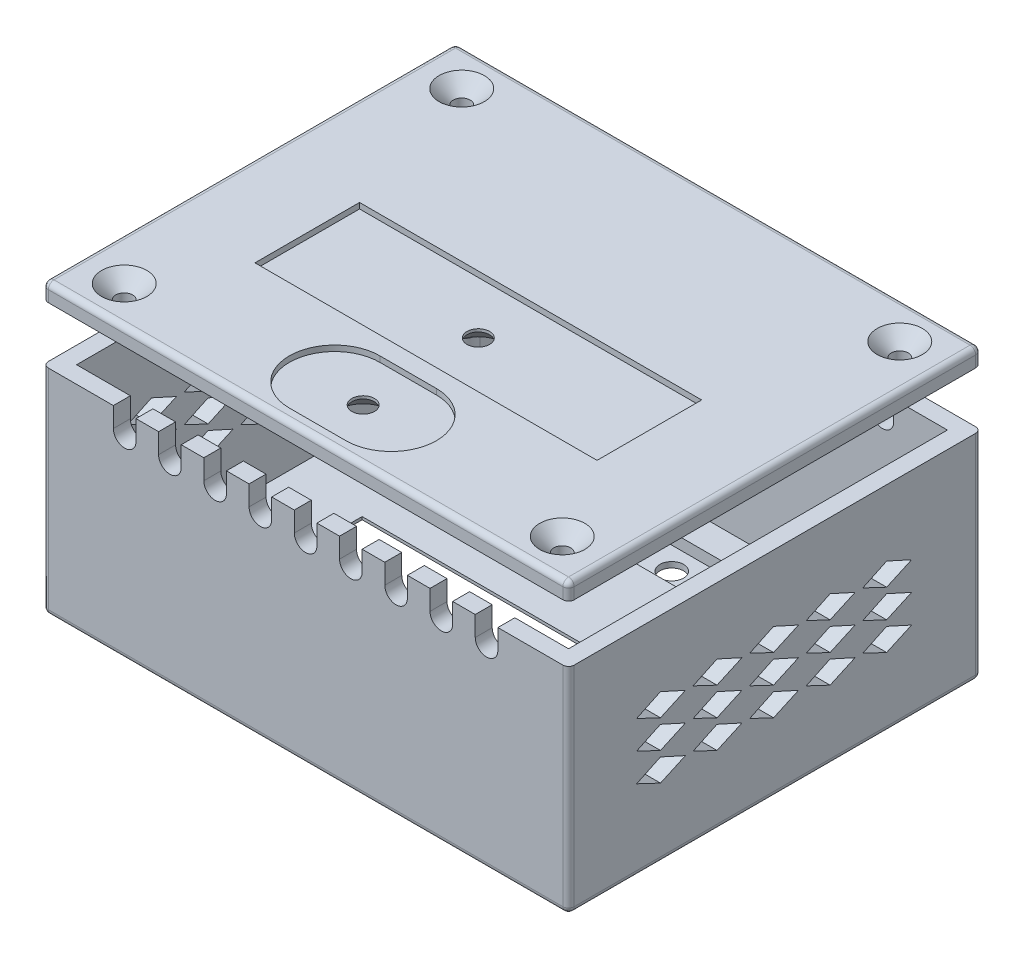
from build123d import *
from OCP.BRepFilletAPI import BRepFilletAPI_MakeChamfer

# Parameters (mm, degrees)
SKETCH_227_W            = 93
SKETCH_227_H            = 73
SKETCH_227_W_2          = 87
SKETCH_227_H_2          = 67
EXTRUDE_477_DEPTH       = 35
SKETCH_2_W              = 93
SKETCH_2_H              = 73
EXTRUDE_524_DEPTH       = 3
SKETCH_1_W              = 60
SKETCH_1_H              = 31
CUT_EXTRUDE_2861_DEPTH  = 3
EXTRUDE_3757_DEPTH      = 2
EXTRUDE_3757_DEPTH_BACK = 3
SKETCH_2_2_R            = 3
SKETCH_2_2_R_2          = 1.5
CHAMFER_3816_SIZE       = 2.5
CHAMFER_3816_SIZE2      = 3
SKETCH_1_3_W            = 28
SKETCH_1_3_H            = 8
CUT_EXTRUDE_1_DEPTH     = 2
SKETCH_1_4_R            = 2.1
CUT_EXTRUDE_2_DEPTH     = 69.698617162
SKETCH_1_5_R            = 1.25
EXTRUDE_3_DEPTH         = 5
FILLET_4_R              = 1
SKETCH_4282_R           = 1.5
EXTRUDE_5048_DEPTH      = 12
CUT_EXTRUDE_6380_DEPTH  = 129.932152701
CUT_EXTRUDE_7651_DEPTH  = 94.360859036
FILLET_2_R              = 1
SKETCH_7_W              = 93
SKETCH_7_H              = 73
SKETCH_7_R              = 1.5
EXTRUDE_8347_DEPTH      = 3
EXTRUDE_START           = -1
SKETCH_7_3_W            = 86
SKETCH_7_3_H            = 66
SKETCH_7_3_R            = 1.5
EXTRUDE_2_DEPTH         = 1
FILLET_3_R              = 1
CHAMFER_2_SIZE          = 2.5
SKETCH_4_W              = 60.5
SKETCH_4_H              = 18.5
CUT_EXTRUDE_1_2_DEPTH   = 1
SKETCH_4_3_R            = 2
CUT_EXTRUDE_2_2_DEPTH   = 5
CHAMFER_3_SIZE          = 2.5
SKETCH_8_W              = 2.198076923
SKETCH_8_H              = 1.058333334
CUT_EXTRUDE_10181_DEPTH = 1


with BuildPart() as part:
    # Sketch 227 → Extrude 477 (new body)
    with BuildSketch(Plane(origin=(0, 0, 0), x_dir=(1, 0, 0), z_dir=(0, 1, 0))):
        Rectangle(SKETCH_227_W, SKETCH_227_H)
        Rectangle(SKETCH_227_W_2, SKETCH_227_H_2, mode=Mode.SUBTRACT)
    extrude(amount=EXTRUDE_477_DEPTH)

    # Sketch 2 → Extrude 524 (add)
    with BuildSketch(Plane(origin=(0, 0, 0), x_dir=(1, 0, 0), z_dir=(0, 1, 0))):
        Rectangle(SKETCH_2_W, SKETCH_2_H)
    extrude(amount=-EXTRUDE_524_DEPTH)

    # Sketch 1 → Cut-Extrude 2861 (cut)
    with BuildSketch(Plane.XZ):
        with Locations((0, 12)):
            Rectangle(SKETCH_1_W, SKETCH_1_H)
    extrude(amount=CUT_EXTRUDE_2861_DEPTH, mode=Mode.SUBTRACT)

    # Sketch 2 2 → Extrude 3757 (add, two sides: drawn at the far end of the back side and taken through both)
    # profile 1 of 4: a face of its own
    with BuildSketch(Plane.XZ.offset(-EXTRUDE_3757_DEPTH_BACK)):
        with Locations(Location((-32.75, -12.5, 0), (0, 0, 270))):
            Circle(SKETCH_2_2_R)
        with Locations(Location((-32.75, -12.5, 0), (0, 0, 270))):
            Circle(SKETCH_2_2_R_2, mode=Mode.SUBTRACT)
    # profile 2 of 4: a face of its own
    with BuildSketch(Plane.XZ.offset(-EXTRUDE_3757_DEPTH_BACK)):
        with Locations(Location((32.75, -12.5, 0), (0, 0, 90))):
            Circle(SKETCH_2_2_R)
        with Locations(Location((32.75, -12.5, 0), (0, 0, 90))):
            Circle(SKETCH_2_2_R_2, mode=Mode.SUBTRACT)
    # profile 3 of 4: a face of its own
    with BuildSketch(Plane.XZ.offset(-EXTRUDE_3757_DEPTH_BACK)):
        with BuildLine():
            Line((29.75, 30.5), (29.75, 35.108230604))
            Line((29.75, 35.108230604), (35.75, 35.108230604))
            Line((35.75, 35.108230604), (35.75, 30.5))
            ThreePointArc((35.75, 30.5), (32.75, 27.5), (29.75, 30.5))
        make_face()
        with Locations(Location((32.75, 30.5, 0), (0, 0, 90))):
            Circle(SKETCH_2_2_R_2, mode=Mode.SUBTRACT)
    # profile 4 of 4: a face of its own
    with BuildSketch(Plane.XZ.offset(-EXTRUDE_3757_DEPTH_BACK)):
        with BuildLine():
            Line((-35.75, 30.5), (-35.75, 35.108230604))
            Line((-35.75, 35.108230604), (-29.75, 35.108230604))
            Line((-29.75, 35.108230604), (-29.75, 30.5))
            ThreePointArc((-29.75, 30.5), (-32.75, 27.5), (-35.75, 30.5))
        make_face()
        with Locations(Location((-32.75, 30.5, 0), (0, 0, 270))):
            Circle(SKETCH_2_2_R_2, mode=Mode.SUBTRACT)
    extrude(amount=EXTRUDE_3757_DEPTH + EXTRUDE_3757_DEPTH_BACK)

    # Chamfer 3816: one chamfer whose edges measure the first distance from different faces: ONE call of the kernel's chamfer builder (chamfer() names one face for all edges)
    chamfer_3816_edges_1 = [part.edges().sort_by_distance(p)[0] for p in [
        (30, -3, 12),
    ]]
    chamfer_3816_side_1 = [part.faces().sort_by_distance(p)[0] for p in [
        (30, -1.5, 12),
    ]]
    chamfer_3816_edges_2 = [part.edges().sort_by_distance(p)[0] for p in [
        (0, -3, 27.5),
    ]]
    chamfer_3816_side_2 = [part.faces().sort_by_distance(p)[0] for p in [
        (0, -1.5, 27.5),
    ]]
    chamfer_3816_edges_3 = [part.edges().sort_by_distance(p)[0] for p in [
        (-30, -3, 12),
    ]]
    chamfer_3816_side_3 = [part.faces().sort_by_distance(p)[0] for p in [
        (-30, -1.5, 12),
    ]]
    chamfer_3816_edges_4 = [part.edges().sort_by_distance(p)[0] for p in [
        (0, -3, -3.5),
    ]]
    chamfer_3816_side_4 = [part.faces().sort_by_distance(p)[0] for p in [
        (0, -1.5, -3.5),
    ]]
    chamfer_3816 = BRepFilletAPI_MakeChamfer(part.part.solid().wrapped)
    for e in chamfer_3816_edges_1:
        chamfer_3816.Add(CHAMFER_3816_SIZE, CHAMFER_3816_SIZE2, e.wrapped, chamfer_3816_side_1[0].wrapped)  # the first distance lies on this face
    for e in chamfer_3816_edges_2:
        chamfer_3816.Add(CHAMFER_3816_SIZE, CHAMFER_3816_SIZE2, e.wrapped, chamfer_3816_side_2[0].wrapped)  # the first distance lies on this face
    for e in chamfer_3816_edges_3:
        chamfer_3816.Add(CHAMFER_3816_SIZE, CHAMFER_3816_SIZE2, e.wrapped, chamfer_3816_side_3[0].wrapped)  # the first distance lies on this face
    for e in chamfer_3816_edges_4:
        chamfer_3816.Add(CHAMFER_3816_SIZE, CHAMFER_3816_SIZE2, e.wrapped, chamfer_3816_side_4[0].wrapped)  # the first distance lies on this face
    add(Compound.cast(chamfer_3816.Shape()), mode=Mode.REPLACE)

    # Sketch 1_3 → Cut-Extrude 1 (cut)
    with BuildSketch(Plane.XZ):
        with Locations((0, -24.5)):
            Rectangle(SKETCH_1_3_W, SKETCH_1_3_H)
    extrude(amount=CUT_EXTRUDE_1_DEPTH, mode=Mode.SUBTRACT)

    # Sketch 1_4 → Cut-Extrude 2 (cut, through all)
    with BuildSketch(Plane.XZ):
        with Locations(Location((-11, -24.5, 0), (0, 0, 90))):
            Circle(SKETCH_1_4_R)
        with Locations(Location((-3.75, -24.5, 0), (0, 0, 90))):
            Circle(SKETCH_1_4_R)
        with Locations(Location((11, -24.5, 0), (0, 0, 90))):
            Circle(SKETCH_1_4_R)
        with Locations(Location((3.75, -24.5, 0), (0, 0, 90))):
            Circle(SKETCH_1_4_R)
    extrude(amount=CUT_EXTRUDE_2_DEPTH, mode=Mode.SUBTRACT)

    # Sketch 1_5 → Extrude 3 (add)
    with BuildSketch(Plane.XZ):
        with Locations(Location((-16.5, -19, 0), (0, 0, 270))):
            Circle(SKETCH_1_5_R)
        with Locations(Location((16.5, -19, 0), (0, 0, 90))):
            Circle(SKETCH_1_5_R)
        with Locations(Location((16.5, -30, 0), (0, 0, 270))):
            Circle(SKETCH_1_5_R)
        with Locations(Location((-16.5, -30, 0), (0, 0, 90))):
            Circle(SKETCH_1_5_R)
    extrude(amount=-EXTRUDE_3_DEPTH)

    # Fillet 4
    fillet_4_edges = [part.edges().sort_by_distance(p)[0] for p in [
        (16.5, 5, -28.75),
        (16.5, 5, -20.25),
        (-16.5, 5, -17.75),
        (-16.5, 5, -31.25),
    ]]
    fillet(fillet_4_edges, radius=FILLET_4_R)

    # Sketch 4282 → Extrude 5048 (add)
    # profile 1 of 4: a face of its own
    with BuildSketch(Plane(origin=(0, 0, 0), x_dir=(1, 0, 0), z_dir=(0, 1, 0))):
        with BuildLine():
            Line((-35.485, -29.845), (-35.485, -34.239974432))
            Line((-35.485, -34.239974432), (-44.325235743, -34.239974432))
            Line((-44.325235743, -34.239974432), (-44.325235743, -26.595))
            Line((-44.325235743, -26.595), (-38.735, -26.595))
            ThreePointArc((-38.735, -26.595), (-36.436902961, -27.546902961), (-35.485, -29.845))
        make_face()
        with Locations(Location((-38.735, -29.845, 0), (0, 0, 270))):
            Circle(SKETCH_4282_R, mode=Mode.SUBTRACT)
    # profile 2 of 4: a face of its own
    with BuildSketch(Plane(origin=(0, 0, 0), x_dir=(1, 0, 0), z_dir=(0, 1, 0))):
        with BuildLine():
            Line((44.325235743, -26.595), (44.325235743, -34.239974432))
            Line((44.325235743, -34.239974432), (35.485, -34.239974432))
            Line((35.485, -34.239974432), (35.485, -29.845))
            ThreePointArc((35.485, -29.845), (36.436902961, -27.546902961), (38.735, -26.595))
            Line((38.735, -26.595), (44.325235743, -26.595))
        make_face()
        with Locations(Location((38.735, -29.845, 0), (0, 0, 90))):
            Circle(SKETCH_4282_R, mode=Mode.SUBTRACT)
    # profile 3 of 4: a face of its own
    with BuildSketch(Plane(origin=(0, 0, 0), x_dir=(1, 0, 0), z_dir=(0, 1, 0))):
        with BuildLine():
            Line((35.485, 29.845), (35.485, 34.239974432))
            Line((35.485, 34.239974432), (44.325235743, 34.239974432))
            Line((44.325235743, 34.239974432), (44.325235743, 26.595))
            Line((44.325235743, 26.595), (38.735, 26.595))
            ThreePointArc((38.735, 26.595), (36.436902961, 27.546902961), (35.485, 29.845))
        make_face()
        with Locations(Location((38.735, 29.845, 0), (0, 0, 270))):
            Circle(SKETCH_4282_R, mode=Mode.SUBTRACT)
    # profile 4 of 4: a face of its own
    with BuildSketch(Plane(origin=(0, 0, 0), x_dir=(1, 0, 0), z_dir=(0, 1, 0))):
        with BuildLine():
            Line((-44.325235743, 26.595), (-44.325235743, 34.239974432))
            Line((-44.325235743, 34.239974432), (-35.485, 34.239974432))
            Line((-35.485, 34.239974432), (-35.485, 29.845))
            ThreePointArc((-35.485, 29.845), (-36.436902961, 27.546902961), (-38.735, 26.595))
            Line((-38.735, 26.595), (-44.325235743, 26.595))
        make_face()
        with Locations(Location((-38.735, 29.845, 0), (0, 0, 90))):
            Circle(SKETCH_4282_R, mode=Mode.SUBTRACT)
    extrude(amount=EXTRUDE_5048_DEPTH)

    # Sketch 5098 → Cut-Extrude 6380 (cut, through all)
    with BuildSketch(Plane(origin=(-46.5, -46.5, 0), x_dir=(0, -1, 0), z_dir=(1, 0, 0))):
        Polygon((-57.799499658, -14.466543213), (-55.799499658, -10.243903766), (-57.799499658, -5.835537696), (-59.799499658, -10.243903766), align=None)
        Polygon((-57.799499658, -24.466543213), (-55.799499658, -20.243903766), (-57.799499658, -15.835537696), (-59.799499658, -20.243903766), align=None)
        Polygon((-62.799499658, -24.466543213), (-60.799499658, -20.243903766), (-62.799499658, -15.835537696), (-64.799499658, -20.243903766), align=None)
        Polygon((-67.799499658, -24.466543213), (-65.799499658, -20.243903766), (-67.799499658, -15.835537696), (-69.799499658, -20.243903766), align=None)
        Polygon((-62.799499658, -14.466543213), (-60.799499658, -10.243903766), (-62.799499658, -5.835537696), (-64.799499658, -10.243903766), align=None)
        Polygon((-67.799499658, -14.466543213), (-65.799499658, -10.243903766), (-67.799499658, -5.835537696), (-69.799499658, -10.243903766), align=None)
        Polygon((-57.799499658, -4.466543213), (-55.799499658, -0.243903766), (-57.799499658, 4.164462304), (-59.799499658, -0.243903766), align=None)
        Polygon((-62.799499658, -4.466543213), (-60.799499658, -0.243903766), (-62.799499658, 4.164462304), (-64.799499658, -0.243903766), align=None)
        Polygon((-67.799499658, -4.466543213), (-65.799499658, -0.243903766), (-67.799499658, 4.164462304), (-69.799499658, -0.243903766), align=None)
        Polygon((-57.799499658, 5.533456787), (-55.799499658, 9.756096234), (-57.799499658, 14.164462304), (-59.799499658, 9.756096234), align=None)
        Polygon((-62.799499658, 5.533456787), (-60.799499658, 9.756096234), (-62.799499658, 14.164462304), (-64.799499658, 9.756096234), align=None)
        Polygon((-67.799499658, 5.533456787), (-65.799499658, 9.756096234), (-67.799499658, 14.164462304), (-69.799499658, 9.756096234), align=None)
        Polygon((-57.799499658, 15.533456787), (-55.799499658, 19.756096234), (-57.799499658, 24.164462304), (-59.799499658, 19.756096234), align=None)
        Polygon((-62.799499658, 15.533456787), (-60.799499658, 19.756096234), (-62.799499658, 24.164462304), (-64.799499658, 19.756096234), align=None)
        Polygon((-67.799499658, 15.533456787), (-65.799499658, 19.756096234), (-67.799499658, 24.164462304), (-69.799499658, 19.756096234), align=None)
    extrude(amount=CUT_EXTRUDE_6380_DEPTH, mode=Mode.SUBTRACT)

    # Sketch 6 → Cut-Extrude 7651 (cut, through all)
    with BuildSketch(Plane(origin=(0, 0, -36.5), x_dir=(-1, 0, 0), z_dir=(0, 0, -1))):
        with BuildLine():
            Line((2, 31.480713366), (2, 35))
            Line((2, 35), (-2, 35))
            Line((-2, 35), (-2, 31.480713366))
            ThreePointArc((-2, 31.480713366), (0, 29.480713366), (2, 31.480713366))
        make_face()
        with BuildLine():
            Line((10, 31.480713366), (10, 35))
            Line((10, 35), (6, 35))
            Line((6, 35), (6, 31.480713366))
            ThreePointArc((6, 31.480713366), (8, 29.480713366), (10, 31.480713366))
        make_face()
        with BuildLine():
            Line((18, 31.480713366), (18, 35))
            Line((18, 35), (14, 35))
            Line((14, 35), (14, 31.480713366))
            ThreePointArc((14, 31.480713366), (16, 29.480713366), (18, 31.480713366))
        make_face()
        with BuildLine():
            Line((26, 31.480713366), (26, 35))
            Line((26, 35), (22, 35))
            Line((22, 35), (22, 31.480713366))
            ThreePointArc((22, 31.480713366), (24, 29.480713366), (26, 31.480713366))
        make_face()
        with BuildLine():
            Line((34, 31.480713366), (34, 35))
            Line((34, 35), (30, 35))
            Line((30, 35), (30, 31.480713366))
            ThreePointArc((30, 31.480713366), (32, 29.480713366), (34, 31.480713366))
        make_face()
        with BuildLine():
            Line((-6, 31.480713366), (-6, 35))
            Line((-6, 35), (-10, 35))
            Line((-10, 35), (-10, 31.480713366))
            ThreePointArc((-10, 31.480713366), (-8, 29.480713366), (-6, 31.480713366))
        make_face()
        with BuildLine():
            Line((-14, 31.480713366), (-14, 35))
            Line((-14, 35), (-18, 35))
            Line((-18, 35), (-18, 31.480713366))
            ThreePointArc((-18, 31.480713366), (-16, 29.480713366), (-14, 31.480713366))
        make_face()
        with BuildLine():
            Line((-22, 31.480713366), (-22, 35))
            Line((-22, 35), (-26, 35))
            Line((-26, 35), (-26, 31.480713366))
            ThreePointArc((-26, 31.480713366), (-24, 29.480713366), (-22, 31.480713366))
        make_face()
        with BuildLine():
            Line((-30, 31.480713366), (-30, 35))
            Line((-30, 35), (-34, 35))
            Line((-34, 35), (-34, 31.480713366))
            ThreePointArc((-34, 31.480713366), (-32, 29.480713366), (-30, 31.480713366))
        make_face()
    extrude(amount=-CUT_EXTRUDE_7651_DEPTH, mode=Mode.SUBTRACT)

    # Fillet 2
    fillet_2_edges = [part.edges().sort_by_distance(p)[0] for p in [
        (0, -3, 36.5),
        (46.5, -3, 0),
        (-46.5, -3, 0),
        (0, -3, -36.5),
        (-46.5, 16, -36.5),
        (46.5, 16, -36.5),
        (46.5, 16, 36.5),
        (-46.5, 16, 36.5),
    ]]
    fillet(fillet_2_edges, radius=FILLET_2_R)

    # Sketch 8 → Cut-Extrude 10181 (cut)
    with BuildSketch(Plane.XZ.offset(3)):
        with Locations((-10.962688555, -15.117212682)):
            Rectangle(SKETCH_8_W, SKETCH_8_H)
        Polygon((-4.571983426, -13.855353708), (-4.571983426, -12.308558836), (-3.513650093, -12.308558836), (-3.513650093, -13.855353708), (-1.885444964, -13.855353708), (-1.885444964, -14.913687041), (-3.513650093, -14.913687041), (-3.513650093, -16.460481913), (-4.571983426, -16.460481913), (-4.571983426, -14.913687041), (-6.200188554, -14.913687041), (-6.200188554, -13.855353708), align=None)
        Polygon((1.778016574, -11.08740499), (5.197247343, -11.08740499), (5.197247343, -12.227148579), (2.917760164, -12.227148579), (2.917760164, -13.448302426), (5.197247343, -13.448302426), (5.197247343, -14.588046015), (2.917760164, -14.588046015), (2.917760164, -16.2976614), (5.197247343, -16.2976614), (5.197247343, -17.43740499), (1.778016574, -17.43740499), align=None)
        with BuildLine():
            Line((12.035708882, -11.935852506), (11.18344526, -12.715610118))
            add(Edge.make_bspline(
                [(11.18344526, -12.715610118), (11.115240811, -12.615550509), (11.008085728, -12.477394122), (10.850124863, -12.319945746), (10.73652598, -12.226881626), (10.621344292, -12.154472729), (10.469317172, -12.086967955), (10.349028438, -12.064069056), (10.270123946, -12.064328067)],
                knots=[0, 0, 0, 0, 0.31182434, 0.448432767, 0.573381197, 0.689077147, 0.797572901, 1, 1, 1, 1], degree=3))
            add(Edge.make_bspline(
                [(10.270123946, -12.064328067), (10.200756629, -12.064216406), (10.097367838, -12.07659847), (9.976136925, -12.134449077), (9.89898156, -12.189349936), (9.837949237, -12.255546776), (9.773768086, -12.346429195), (9.756826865, -12.428031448), (9.756221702, -12.480283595)],
                knots=[0, 0, 0, 0, 0.285992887, 0.416634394, 0.547379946, 0.671582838, 0.784400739, 1, 1, 1, 1], degree=3))
            add(Edge.make_bspline(
                [(9.756221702, -12.480283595), (9.755439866, -12.533591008), (9.775703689, -12.642360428), (9.828641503, -12.739272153), (9.861800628, -12.784300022)],
                knots=[0, 0, 0, 0, 0.487115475, 1, 1, 1, 1], degree=3))
            add(Edge.make_bspline(
                [(9.861800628, -12.784300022), (9.894291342, -12.827692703), (9.957541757, -12.89570312), (10.054651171, -12.994699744), (10.154583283, -13.089388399), (10.269935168, -13.199711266), (10.462336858, -13.371950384), (10.615262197, -13.508617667), (10.724240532, -13.603490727)],
                knots=[0, 0, 0, 0, 0.136349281, 0.233805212, 0.349411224, 0.48317915, 0.635966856, 1, 1, 1, 1], degree=3))
            add(Edge.make_bspline(
                [(10.724240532, -13.603490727), (10.825342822, -13.691530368), (10.970308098, -13.815212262), (11.150016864, -13.973999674), (11.261144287, -14.071853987), (11.354942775, -14.156575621), (11.447206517, -14.24283398), (11.507829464, -14.300959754), (11.542159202, -14.336183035)],
                knots=[0, 0, 0, 0, 0.366184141, 0.520457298, 0.655012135, 0.770624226, 0.865677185, 1, 1, 1, 1], degree=3))
            add(Edge.make_bspline(
                [(11.542159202, -14.336183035), (11.651612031, -14.451024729), (11.800953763, -14.624852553), (11.961298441, -14.870676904), (12.050521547, -15.046105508), (12.117801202, -15.223115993), (12.182176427, -15.469812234), (12.198660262, -15.662666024), (12.198529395, -15.792663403)],
                knots=[0, 0, 0, 0, 0.289954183, 0.417138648, 0.535255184, 0.648751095, 0.762405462, 1, 1, 1, 1], degree=3))
            add(Edge.make_bspline(
                [(12.198529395, -15.792663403), (12.200576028, -15.918626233), (12.182059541, -16.104100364), (12.128833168, -16.342979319), (12.06869062, -16.509377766), (11.995269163, -16.66867708), (11.90325735, -16.818399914), (11.795193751, -16.960060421), (11.671338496, -17.091126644), (11.534339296, -17.210059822), (11.387394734, -17.315938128), (11.229067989, -17.403349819), (11.060710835, -17.475343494), (10.882417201, -17.530731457), (10.626733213, -17.586725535), (10.427039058, -17.600475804), (10.291748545, -17.600225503)],
                knots=[0, 0, 0, 0, 0.127926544, 0.18904691, 0.248543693, 0.307607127, 0.36724766, 0.426963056, 0.488617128, 0.550391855, 0.611330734, 0.672556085, 0.734024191, 0.797340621, 0.862249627, 1, 1, 1, 1], degree=3))
            add(Edge.make_bspline(
                [(10.291748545, -17.600225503), (10.184208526, -17.600143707), (10.024968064, -17.5907372), (9.818261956, -17.556603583), (9.670805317, -17.520600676), (9.528307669, -17.474926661), (9.390763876, -17.419151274), (9.259123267, -17.352395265), (9.13238981, -17.276035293), (9.011179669, -17.187371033), (8.893959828, -17.0882156), (8.781896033, -16.977043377), (8.674444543, -16.854119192), (8.572314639, -16.719087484), (8.435743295, -16.52121715), (8.347992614, -16.359269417), (8.290837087, -16.248052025)],
                knots=[0, 0, 0, 0, 0.125868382, 0.18624025, 0.244976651, 0.303357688, 0.361230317, 0.418489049, 0.475936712, 0.534203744, 0.594059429, 0.655468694, 0.718771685, 0.784974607, 0.853522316, 1, 1, 1, 1], degree=3))
            Line((8.290837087, -16.248052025), (9.293200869, -15.646379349))
            add(Edge.make_bspline(
                [(9.293200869, -15.646379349), (9.361469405, -15.771068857), (9.472477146, -15.943744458), (9.64459515, -16.141620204), (9.773512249, -16.257263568), (9.906699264, -16.347952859), (10.088804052, -16.434136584), (10.236310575, -16.460682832), (10.333725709, -16.460481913)],
                knots=[0, 0, 0, 0, 0.307611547, 0.442138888, 0.566229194, 0.681222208, 0.789558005, 1, 1, 1, 1], degree=3))
            add(Edge.make_bspline(
                [(10.333725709, -16.460481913), (10.429502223, -16.461207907), (10.570599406, -16.439461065), (10.741352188, -16.362483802), (10.849852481, -16.282332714), (10.941544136, -16.189699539), (11.031436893, -16.054062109), (11.060144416, -15.936328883), (11.058785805, -15.858809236)],
                knots=[0, 0, 0, 0, 0.275473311, 0.404345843, 0.535429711, 0.661427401, 0.77786684, 1, 1, 1, 1], degree=3))
            add(Edge.make_bspline(
                [(11.058785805, -15.858809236), (11.058615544, -15.785005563), (11.036362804, -15.6726417), (10.972170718, -15.530138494), (10.914405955, -15.440407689), (10.855509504, -15.365283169), (10.799209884, -15.300190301), (10.730645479, -15.22827453), (10.649997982, -15.149444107), (10.558327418, -15.063009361), (10.414517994, -14.931385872), (10.298153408, -14.832067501), (10.216698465, -14.763586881)],
                knots=[0, 0, 0, 0, 0.155090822, 0.238351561, 0.32840414, 0.37938386, 0.439617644, 0.509831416, 0.588874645, 0.677436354, 0.77554672, 1, 1, 1, 1], degree=3))
            add(Edge.make_bspline(
                [(10.216698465, -14.763586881), (10.061007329, -14.633009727), (9.839520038, -14.441716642), (9.564007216, -14.188908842), (9.389855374, -14.018183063), (9.236884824, -13.861037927), (9.106114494, -13.71621255), (8.998997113, -13.582585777), (8.886241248, -13.424315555), (8.77932097, -13.231443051), (8.65738071, -12.928237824), (8.614811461, -12.691081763), (8.616478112, -12.534981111)],
                knots=[0, 0, 0, 0, 0.215201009, 0.309902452, 0.395959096, 0.473447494, 0.542140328, 0.602523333, 0.654726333, 0.747804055, 0.835278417, 1, 1, 1, 1], degree=3))
            add(Edge.make_bspline(
                [(8.616478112, -12.534981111), (8.615850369, -12.427822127), (8.631890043, -12.26894415), (8.681003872, -12.064070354), (8.73347654, -11.918190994), (8.801683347, -11.778575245), (8.88449146, -11.644537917), (8.983215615, -11.517313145), (9.094469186, -11.396985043), (9.217042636, -11.287019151), (9.34802786, -11.189962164), (9.486683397, -11.107990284), (9.632161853, -11.039974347), (9.785361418, -10.987965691), (10.001490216, -10.93783509), (10.169618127, -10.925288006), (10.282844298, -10.924584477)],
                knots=[0, 0, 0, 0, 0.12445736, 0.184840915, 0.244566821, 0.304319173, 0.365199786, 0.427420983, 0.491261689, 0.555499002, 0.618604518, 0.680494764, 0.742473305, 0.804990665, 0.868251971, 1, 1, 1, 1], degree=3))
            add(Edge.make_bspline(
                [(10.282844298, -10.924584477), (10.431940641, -10.924659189), (10.655532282, -10.952646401), (10.942314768, -11.042551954), (11.115763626, -11.123333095), (11.253772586, -11.201703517), (11.359543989, -11.273839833), (11.467170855, -11.35648161), (11.577527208, -11.449878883), (11.688537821, -11.555812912), (11.846248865, -11.714820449), (11.960539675, -11.844423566), (12.035708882, -11.935852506)],
                knots=[0, 0, 0, 0, 0.212976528, 0.319776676, 0.428556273, 0.485856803, 0.546558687, 0.611431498, 0.67982091, 0.753158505, 0.830752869, 1, 1, 1, 1], degree=3))
        make_face()
    extrude(amount=-CUT_EXTRUDE_10181_DEPTH, mode=Mode.SUBTRACT)


with BuildPart() as body_2:
    # Sketch 7 → Extrude 8347 (new body)
    with BuildSketch(Plane(origin=(0, 45, 0), x_dir=(1, 0, 0), z_dir=(0, 1, 0))):
        Rectangle(SKETCH_7_W, SKETCH_7_H)
        with Locations(Location((-38.735, 29.845, 0), (0, 0, 270))):
            Circle(SKETCH_7_R, mode=Mode.SUBTRACT)
        with Locations(Location((38.735, 29.845, 0), (0, 0, 270))):
            Circle(SKETCH_7_R, mode=Mode.SUBTRACT)
        with Locations(Location((38.735, -29.845, 0), (0, 0, 270))):
            Circle(SKETCH_7_R, mode=Mode.SUBTRACT)
        with Locations(Location((-38.735, -29.845, 0), (0, 0, 270))):
            Circle(SKETCH_7_R, mode=Mode.SUBTRACT)
    extrude(amount=EXTRUDE_8347_DEPTH)

    # Sketch 7_3 → Extrude 2 (add)
    with BuildSketch(Plane(origin=(0, 45, 0), x_dir=(1, 0, 0), z_dir=(0, 1, 0)).offset(EXTRUDE_START)):
        Rectangle(SKETCH_7_3_W, SKETCH_7_3_H)
        with Locations(Location((-38.735, 29.845, 0), (0, 0, 270))):
            Circle(SKETCH_7_3_R, mode=Mode.SUBTRACT)
        with Locations(Location((38.735, 29.845, 0), (0, 0, 270))):
            Circle(SKETCH_7_3_R, mode=Mode.SUBTRACT)
        with Locations(Location((38.735, -29.845, 0), (0, 0, 270))):
            Circle(SKETCH_7_3_R, mode=Mode.SUBTRACT)
        with Locations(Location((-38.735, -29.845, 0), (0, 0, 270))):
            Circle(SKETCH_7_3_R, mode=Mode.SUBTRACT)
    extrude(amount=EXTRUDE_2_DEPTH)

    # Fillet 3
    fillet_3_edges = [body_2.edges().sort_by_distance(p)[0] for p in [
        (0, 48, -36.5),
        (-46.5, 48, 0),
        (0, 48, 36.5),
        (-46.5, 46.5, 36.5),
        (-46.5, 46.5, -36.5),
        (46.5, 46.5, -36.5),
        (46.5, 46.5, 36.5),
        (46.5, 48, 0),
    ]]
    fillet(fillet_3_edges, radius=FILLET_3_R)

    # Chamfer 2
    chamfer_2_edges = [body_2.edges().sort_by_distance(p)[0] for p in [
        (-38.735, 48, -31.345),
        (38.735, 48, -31.345),
        (38.735, 48, 28.345),
        (-38.735, 48, 28.345),
    ]]
    chamfer(chamfer_2_edges, length=CHAMFER_2_SIZE)

    # Sketch 4 → Cut-Extrude 1 2 (cut)
    with BuildSketch(Plane(origin=(0, 48, 0), x_dir=(-1, 0, 0), z_dir=(0, 1, 0))):
        with BuildLine():
            Line((5.049026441, 18.319021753), (-4.950973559, 18.319021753))
            ThreePointArc((-4.950973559, 18.319021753), (-12.950973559, 26.319021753), (-4.950973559, 34.319021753))
            Line((-4.950973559, 34.319021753), (5.049026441, 34.319021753))
            ThreePointArc((5.049026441, 34.319021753), (13.049026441, 26.319021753), (5.049026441, 18.319021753))
        make_face()
        with Locations((0.085418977, 5.873619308)):
            Rectangle(SKETCH_4_W, SKETCH_4_H)
    extrude(amount=-CUT_EXTRUDE_1_2_DEPTH, mode=Mode.SUBTRACT)

    # Sketch 4_3 → Cut-Extrude 2 2 (cut)
    with BuildSketch(Plane(origin=(0, 48, 0), x_dir=(-1, 0, 0), z_dir=(0, 1, 0))):
        with Locations(Location((0, 26.319021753, 0), (0, 0, 90))):
            Circle(SKETCH_4_3_R)
        with Locations(Location((0.085418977, 5.873619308, 0), (0, 0, 90))):
            Circle(SKETCH_4_3_R)
    extrude(amount=-CUT_EXTRUDE_2_2_DEPTH, mode=Mode.SUBTRACT)

    # Chamfer 3
    chamfer_3_edges = [body_2.edges().sort_by_distance(p)[0] for p in [
        (-0.085418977, 44, 3.873619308),
        (0, 44, 24.319021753),
    ]]
    chamfer(chamfer_3_edges, length=CHAMFER_3_SIZE)


solid = Compound([part.part, body_2.part])
